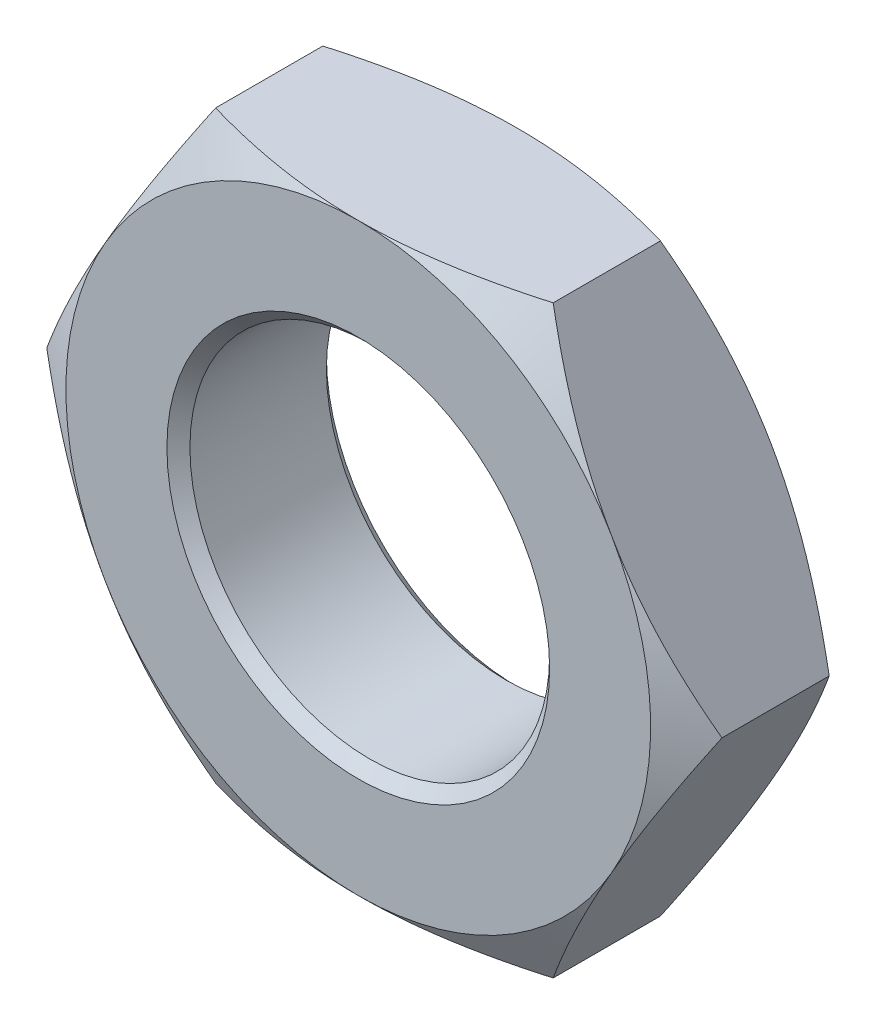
ISO-10303-21;
HEADER;
FILE_DESCRIPTION(('STEP AP214'),'2;1');
FILE_NAME('part.step','',(''),(''),'','','');
FILE_SCHEMA(('AUTOMOTIVE_DESIGN { 1 0 10303 214 1 1 1 1 }'));
ENDSEC;
DATA;
#1=APPLICATION_CONTEXT('core data for automotive mechanical design processes');
#2=APPLICATION_PROTOCOL_DEFINITION('international standard','automotive_design',2000,#1);
#3=PRODUCT_CONTEXT('',#1,'mechanical');
#4=PRODUCT('Part','Part','',(#3));
#5=PRODUCT_RELATED_PRODUCT_CATEGORY('part','',(#4));
#6=PRODUCT_DEFINITION_FORMATION('','',#4);
#7=PRODUCT_DEFINITION_CONTEXT('part definition',#1,'design');
#8=PRODUCT_DEFINITION('design','',#6,#7);
#9=PRODUCT_DEFINITION_SHAPE('','',#8);
#10=(LENGTH_UNIT() NAMED_UNIT(*) SI_UNIT(.MILLI.,.METRE.));
#11=(NAMED_UNIT(*) PLANE_ANGLE_UNIT() SI_UNIT($,.RADIAN.));
#12=(NAMED_UNIT(*) SI_UNIT($,.STERADIAN.) SOLID_ANGLE_UNIT());
#13=UNCERTAINTY_MEASURE_WITH_UNIT(LENGTH_MEASURE(1.E-05),#10,'distance_accuracy_value','');
#14=(GEOMETRIC_REPRESENTATION_CONTEXT(3) GLOBAL_UNCERTAINTY_ASSIGNED_CONTEXT((#13)) GLOBAL_UNIT_ASSIGNED_CONTEXT((#10,
#11,#12)) REPRESENTATION_CONTEXT('',''));
#15=CARTESIAN_POINT('',(0.,0.,0.));
#16=DIRECTION('',(0.,0.,1.));
#17=DIRECTION('',(1.,0.,0.));
#18=AXIS2_PLACEMENT_3D('',#15,#16,#17);
#19=CARTESIAN_POINT('',(23.8156986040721,-13.75,132.));
#20=DIRECTION('',(0.866025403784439,-0.5,0.));
#21=DIRECTION('',(-0.5,-0.866025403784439,0.));
#22=AXIS2_PLACEMENT_3D('',#19,#20,#21);
#23=PLANE('',#22);
#24=CARTESIAN_POINT('',(15.8689004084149,-27.5142582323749,128.539044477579));
#25=CARTESIAN_POINT('',(20.1280892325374,-20.1371267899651,131.));
#26=CARTESIAN_POINT('',(23.8156986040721,-13.75,131.));
#27=CARTESIAN_POINT('',(27.5033079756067,-7.36287321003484,131.));
#28=CARTESIAN_POINT('',(31.7624967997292,0.0142582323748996,128.539044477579));
#29=(BOUNDED_CURVE() B_SPLINE_CURVE(2,(#24,#25,#26,#27,#28),.UNSPECIFIED.,.F.,
.F.) B_SPLINE_CURVE_WITH_KNOTS((3,2,3),(0.,16.1241200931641,32.2482401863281),
.UNSPECIFIED.) CURVE() GEOMETRIC_REPRESENTATION_ITEM() RATIONAL_B_SPLINE_CURVE((1.,
1.03802697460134,1.,1.03802697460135,1.)) REPRESENTATION_ITEM(''));
#30=CARTESIAN_POINT('',(15.8771324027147,-27.5,128.543799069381));
#31=VERTEX_POINT('',#30);
#32=CARTESIAN_POINT('',(23.8156986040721,-13.75,131.));
#33=VERTEX_POINT('',#32);
#34=EDGE_CURVE('E145',#31,#33,#29,.T.);
#35=ORIENTED_EDGE('',*,*,#34,.F.);
#36=DIRECTION('',(0.,0.,-1.));
#37=VECTOR('',#36,1.);
#38=CARTESIAN_POINT('',(15.8771324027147,-27.5,132.));
#39=LINE('',#38,#37);
#40=CARTESIAN_POINT('',(15.8771324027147,-27.5,118.456200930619));
#41=VERTEX_POINT('',#40);
#42=EDGE_CURVE('E11',#31,#41,#39,.T.);
#43=ORIENTED_EDGE('',*,*,#42,.T.);
#44=CARTESIAN_POINT('',(31.7624967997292,0.0142582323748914,118.460955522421));
#45=CARTESIAN_POINT('',(27.5033079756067,-7.36287321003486,116.));
#46=CARTESIAN_POINT('',(23.8156986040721,-13.75,116.));
#47=CARTESIAN_POINT('',(20.1280892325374,-20.1371267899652,116.));
#48=CARTESIAN_POINT('',(15.8689004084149,-27.5142582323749,118.460955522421));
#49=(BOUNDED_CURVE() B_SPLINE_CURVE(2,(#44,#45,#46,#47,#48),.UNSPECIFIED.,.F.,
.F.) B_SPLINE_CURVE_WITH_KNOTS((3,2,3),(0.,16.1241200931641,32.2482401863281),
.UNSPECIFIED.) CURVE() GEOMETRIC_REPRESENTATION_ITEM() RATIONAL_B_SPLINE_CURVE((1.,
1.03802697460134,1.,1.03802697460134,1.)) REPRESENTATION_ITEM(''));
#50=CARTESIAN_POINT('',(23.8156986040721,-13.75,116.));
#51=VERTEX_POINT('',#50);
#52=EDGE_CURVE('E277',#51,#41,#49,.T.);
#53=ORIENTED_EDGE('',*,*,#52,.F.);
#54=CARTESIAN_POINT('',(31.7624967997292,0.0142582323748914,118.460955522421));
#55=CARTESIAN_POINT('',(27.5033079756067,-7.36287321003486,116.));
#56=CARTESIAN_POINT('',(23.8156986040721,-13.75,116.));
#57=CARTESIAN_POINT('',(20.1280892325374,-20.1371267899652,116.));
#58=CARTESIAN_POINT('',(15.8689004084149,-27.5142582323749,118.460955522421));
#59=(BOUNDED_CURVE() B_SPLINE_CURVE(2,(#54,#55,#56,#57,#58),.UNSPECIFIED.,.F.,
.F.) B_SPLINE_CURVE_WITH_KNOTS((3,2,3),(0.,16.1241200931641,32.2482401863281),
.UNSPECIFIED.) CURVE() GEOMETRIC_REPRESENTATION_ITEM() RATIONAL_B_SPLINE_CURVE((1.,
1.03802697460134,1.,1.03802697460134,1.)) REPRESENTATION_ITEM(''));
#60=CARTESIAN_POINT('',(31.7542648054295,0.,118.456200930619));
#61=VERTEX_POINT('',#60);
#62=EDGE_CURVE('E234',#61,#51,#59,.T.);
#63=ORIENTED_EDGE('',*,*,#62,.F.);
#64=DIRECTION('',(0.,0.,-1.));
#65=VECTOR('',#64,1.);
#66=CARTESIAN_POINT('',(31.7542648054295,0.,132.));
#67=LINE('',#66,#65);
#68=CARTESIAN_POINT('',(31.7542648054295,0.,128.543799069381));
#69=VERTEX_POINT('',#68);
#70=EDGE_CURVE('E112',#69,#61,#67,.T.);
#71=ORIENTED_EDGE('',*,*,#70,.F.);
#72=CARTESIAN_POINT('',(15.8689004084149,-27.5142582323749,128.539044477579));
#73=CARTESIAN_POINT('',(20.1280892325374,-20.1371267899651,131.));
#74=CARTESIAN_POINT('',(23.8156986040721,-13.75,131.));
#75=CARTESIAN_POINT('',(27.5033079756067,-7.36287321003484,131.));
#76=CARTESIAN_POINT('',(31.7624967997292,0.0142582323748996,128.539044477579));
#77=(BOUNDED_CURVE() B_SPLINE_CURVE(2,(#72,#73,#74,#75,#76),.UNSPECIFIED.,.F.,
.F.) B_SPLINE_CURVE_WITH_KNOTS((3,2,3),(0.,16.1241200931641,32.2482401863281),
.UNSPECIFIED.) CURVE() GEOMETRIC_REPRESENTATION_ITEM() RATIONAL_B_SPLINE_CURVE((1.,
1.03802697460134,1.,1.03802697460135,1.)) REPRESENTATION_ITEM(''));
#78=EDGE_CURVE('E147',#33,#69,#77,.T.);
#79=ORIENTED_EDGE('',*,*,#78,.F.);
#80=EDGE_LOOP('',(#35,#43,#53,#63,#71,#79));
#81=FACE_BOUND('',#80,.T.);
#82=ADVANCED_FACE('F16',(#81),#23,.T.);
#83=CARTESIAN_POINT('',(0.,-27.5,132.));
#84=DIRECTION('',(0.,-1.,0.));
#85=DIRECTION('',(-1.,0.,0.));
#86=AXIS2_PLACEMENT_3D('',#83,#84,#85);
#87=PLANE('',#86);
#88=CARTESIAN_POINT('',(-15.8935963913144,-27.5,128.539044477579));
#89=CARTESIAN_POINT('',(-7.37521874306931,-27.5,131.));
#90=CARTESIAN_POINT('',(0.,-27.5,131.));
#91=CARTESIAN_POINT('',(7.37521874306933,-27.5,131.));
#92=CARTESIAN_POINT('',(15.8935963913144,-27.5,128.539044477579));
#93=(BOUNDED_CURVE() B_SPLINE_CURVE(2,(#88,#89,#90,#91,#92),.UNSPECIFIED.,.F.,
.F.) B_SPLINE_CURVE_WITH_KNOTS((3,2,3),(0.,16.1241200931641,32.2482401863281),
.UNSPECIFIED.) CURVE() GEOMETRIC_REPRESENTATION_ITEM() RATIONAL_B_SPLINE_CURVE((1.,
1.03802697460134,1.,1.03802697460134,1.)) REPRESENTATION_ITEM(''));
#94=CARTESIAN_POINT('',(-15.8771324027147,-27.5,128.543799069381));
#95=VERTEX_POINT('',#94);
#96=CARTESIAN_POINT('',(0.,-27.5,131.));
#97=VERTEX_POINT('',#96);
#98=EDGE_CURVE('E152',#95,#97,#93,.T.);
#99=ORIENTED_EDGE('',*,*,#98,.F.);
#100=DIRECTION('',(0.,0.,-1.));
#101=VECTOR('',#100,1.);
#102=CARTESIAN_POINT('',(-15.8771324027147,-27.5,132.));
#103=LINE('',#102,#101);
#104=CARTESIAN_POINT('',(-15.8771324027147,-27.5,118.456200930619));
#105=VERTEX_POINT('',#104);
#106=EDGE_CURVE('E26',#95,#105,#103,.T.);
#107=ORIENTED_EDGE('',*,*,#106,.T.);
#108=CARTESIAN_POINT('',(15.8935963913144,-27.5,118.460955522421));
#109=CARTESIAN_POINT('',(7.3752187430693,-27.5,116.));
#110=CARTESIAN_POINT('',(0.,-27.5,116.));
#111=CARTESIAN_POINT('',(-7.37521874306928,-27.5,116.));
#112=CARTESIAN_POINT('',(-15.8935963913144,-27.5,118.460955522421));
#113=(BOUNDED_CURVE() B_SPLINE_CURVE(2,(#108,#109,#110,#111,#112),.UNSPECIFIED.,.F.,
.F.) B_SPLINE_CURVE_WITH_KNOTS((3,2,3),(0.,16.1241200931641,32.2482401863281),
.UNSPECIFIED.) CURVE() GEOMETRIC_REPRESENTATION_ITEM() RATIONAL_B_SPLINE_CURVE((1.,
1.03802697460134,1.,1.03802697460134,1.)) REPRESENTATION_ITEM(''));
#114=CARTESIAN_POINT('',(0.,-27.5,116.));
#115=VERTEX_POINT('',#114);
#116=EDGE_CURVE('E241',#115,#105,#113,.T.);
#117=ORIENTED_EDGE('',*,*,#116,.F.);
#118=CARTESIAN_POINT('',(15.8935963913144,-27.5,118.460955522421));
#119=CARTESIAN_POINT('',(7.3752187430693,-27.5,116.));
#120=CARTESIAN_POINT('',(0.,-27.5,116.));
#121=CARTESIAN_POINT('',(-7.37521874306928,-27.5,116.));
#122=CARTESIAN_POINT('',(-15.8935963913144,-27.5,118.460955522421));
#123=(BOUNDED_CURVE() B_SPLINE_CURVE(2,(#118,#119,#120,#121,#122),.UNSPECIFIED.,.F.,
.F.) B_SPLINE_CURVE_WITH_KNOTS((3,2,3),(0.,16.1241200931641,32.2482401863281),
.UNSPECIFIED.) CURVE() GEOMETRIC_REPRESENTATION_ITEM() RATIONAL_B_SPLINE_CURVE((1.,
1.03802697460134,1.,1.03802697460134,1.)) REPRESENTATION_ITEM(''));
#124=EDGE_CURVE('E142',#41,#115,#123,.T.);
#125=ORIENTED_EDGE('',*,*,#124,.F.);
#126=ORIENTED_EDGE('',*,*,#42,.F.);
#127=CARTESIAN_POINT('',(-15.8935963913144,-27.5,128.539044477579));
#128=CARTESIAN_POINT('',(-7.37521874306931,-27.5,131.));
#129=CARTESIAN_POINT('',(0.,-27.5,131.));
#130=CARTESIAN_POINT('',(7.37521874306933,-27.5,131.));
#131=CARTESIAN_POINT('',(15.8935963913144,-27.5,128.539044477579));
#132=(BOUNDED_CURVE() B_SPLINE_CURVE(2,(#127,#128,#129,#130,#131),.UNSPECIFIED.,.F.,
.F.) B_SPLINE_CURVE_WITH_KNOTS((3,2,3),(0.,16.1241200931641,32.2482401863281),
.UNSPECIFIED.) CURVE() GEOMETRIC_REPRESENTATION_ITEM() RATIONAL_B_SPLINE_CURVE((1.,
1.03802697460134,1.,1.03802697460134,1.)) REPRESENTATION_ITEM(''));
#133=EDGE_CURVE('E139',#97,#31,#132,.T.);
#134=ORIENTED_EDGE('',*,*,#133,.F.);
#135=EDGE_LOOP('',(#99,#107,#117,#125,#126,#134));
#136=FACE_BOUND('',#135,.T.);
#137=ADVANCED_FACE('F138',(#136),#87,.T.);
#138=CARTESIAN_POINT('',(-23.8156986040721,-13.75,132.));
#139=DIRECTION('',(-0.866025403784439,-0.5,0.));
#140=DIRECTION('',(-0.5,0.866025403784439,0.));
#141=AXIS2_PLACEMENT_3D('',#138,#139,#140);
#142=PLANE('',#141);
#143=CARTESIAN_POINT('',(-31.7624967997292,0.0142582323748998,128.539044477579));
#144=CARTESIAN_POINT('',(-27.5033079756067,-7.36287321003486,131.));
#145=CARTESIAN_POINT('',(-23.8156986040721,-13.75,131.));
#146=CARTESIAN_POINT('',(-20.1280892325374,-20.1371267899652,131.));
#147=CARTESIAN_POINT('',(-15.8689004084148,-27.5142582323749,128.539044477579));
#148=(BOUNDED_CURVE() B_SPLINE_CURVE(2,(#143,#144,#145,#146,#147),.UNSPECIFIED.,.F.,
.F.) B_SPLINE_CURVE_WITH_KNOTS((3,2,3),(0.,16.1241200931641,32.2482401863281),
.UNSPECIFIED.) CURVE() GEOMETRIC_REPRESENTATION_ITEM() RATIONAL_B_SPLINE_CURVE((1.,
1.03802697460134,1.,1.03802697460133,1.)) REPRESENTATION_ITEM(''));
#149=CARTESIAN_POINT('',(-31.7542648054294,0.,128.543799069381));
#150=VERTEX_POINT('',#149);
#151=CARTESIAN_POINT('',(-23.8156986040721,-13.75,131.));
#152=VERTEX_POINT('',#151);
#153=EDGE_CURVE('E179',#150,#152,#148,.T.);
#154=ORIENTED_EDGE('',*,*,#153,.F.);
#155=DIRECTION('',(0.,0.,-1.));
#156=VECTOR('',#155,1.);
#157=CARTESIAN_POINT('',(-31.7542648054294,0.,132.));
#158=LINE('',#157,#156);
#159=CARTESIAN_POINT('',(-31.7542648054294,0.,118.456200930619));
#160=VERTEX_POINT('',#159);
#161=EDGE_CURVE('E59',#150,#160,#158,.T.);
#162=ORIENTED_EDGE('',*,*,#161,.T.);
#163=CARTESIAN_POINT('',(-15.8689004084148,-27.5142582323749,118.460955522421));
#164=CARTESIAN_POINT('',(-20.1280892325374,-20.1371267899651,116.));
#165=CARTESIAN_POINT('',(-23.8156986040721,-13.75,116.));
#166=CARTESIAN_POINT('',(-27.5033079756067,-7.36287321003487,116.));
#167=CARTESIAN_POINT('',(-31.7624967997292,0.0142582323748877,118.460955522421));
#168=(BOUNDED_CURVE() B_SPLINE_CURVE(2,(#163,#164,#165,#166,#167),.UNSPECIFIED.,.F.,
.F.) B_SPLINE_CURVE_WITH_KNOTS((3,2,3),(0.,16.1241200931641,32.2482401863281),
.UNSPECIFIED.) CURVE() GEOMETRIC_REPRESENTATION_ITEM() RATIONAL_B_SPLINE_CURVE((1.,
1.03802697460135,1.,1.03802697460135,1.)) REPRESENTATION_ITEM(''));
#169=CARTESIAN_POINT('',(-23.8156986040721,-13.75,116.));
#170=VERTEX_POINT('',#169);
#171=EDGE_CURVE('E158',#170,#160,#168,.T.);
#172=ORIENTED_EDGE('',*,*,#171,.F.);
#173=CARTESIAN_POINT('',(-15.8689004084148,-27.5142582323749,118.460955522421));
#174=CARTESIAN_POINT('',(-20.1280892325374,-20.1371267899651,116.));
#175=CARTESIAN_POINT('',(-23.8156986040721,-13.75,116.));
#176=CARTESIAN_POINT('',(-27.5033079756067,-7.36287321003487,116.));
#177=CARTESIAN_POINT('',(-31.7624967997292,0.0142582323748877,118.460955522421));
#178=(BOUNDED_CURVE() B_SPLINE_CURVE(2,(#173,#174,#175,#176,#177),.UNSPECIFIED.,.F.,
.F.) B_SPLINE_CURVE_WITH_KNOTS((3,2,3),(0.,16.1241200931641,32.2482401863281),
.UNSPECIFIED.) CURVE() GEOMETRIC_REPRESENTATION_ITEM() RATIONAL_B_SPLINE_CURVE((1.,
1.03802697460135,1.,1.03802697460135,1.)) REPRESENTATION_ITEM(''));
#179=EDGE_CURVE('E242',#105,#170,#178,.T.);
#180=ORIENTED_EDGE('',*,*,#179,.F.);
#181=ORIENTED_EDGE('',*,*,#106,.F.);
#182=CARTESIAN_POINT('',(-31.7624967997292,0.0142582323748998,128.539044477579));
#183=CARTESIAN_POINT('',(-27.5033079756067,-7.36287321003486,131.));
#184=CARTESIAN_POINT('',(-23.8156986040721,-13.75,131.));
#185=CARTESIAN_POINT('',(-20.1280892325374,-20.1371267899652,131.));
#186=CARTESIAN_POINT('',(-15.8689004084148,-27.5142582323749,128.539044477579));
#187=(BOUNDED_CURVE() B_SPLINE_CURVE(2,(#182,#183,#184,#185,#186),.UNSPECIFIED.,.F.,
.F.) B_SPLINE_CURVE_WITH_KNOTS((3,2,3),(0.,16.1241200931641,32.2482401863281),
.UNSPECIFIED.) CURVE() GEOMETRIC_REPRESENTATION_ITEM() RATIONAL_B_SPLINE_CURVE((1.,
1.03802697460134,1.,1.03802697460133,1.)) REPRESENTATION_ITEM(''));
#188=EDGE_CURVE('E177',#152,#95,#187,.T.);
#189=ORIENTED_EDGE('',*,*,#188,.F.);
#190=EDGE_LOOP('',(#154,#162,#172,#180,#181,#189));
#191=FACE_BOUND('',#190,.T.);
#192=ADVANCED_FACE('F390',(#191),#142,.T.);
#193=CARTESIAN_POINT('',(23.8156986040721,13.75,132.));
#194=DIRECTION('',(0.866025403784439,0.5,0.));
#195=DIRECTION('',(0.5,-0.866025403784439,0.));
#196=AXIS2_PLACEMENT_3D('',#193,#194,#195);
#197=PLANE('',#196);
#198=CARTESIAN_POINT('',(31.7624967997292,-0.0142582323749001,128.539044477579));
#199=CARTESIAN_POINT('',(27.5033079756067,7.36287321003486,131.));
#200=CARTESIAN_POINT('',(23.8156986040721,13.75,131.));
#201=CARTESIAN_POINT('',(20.1280892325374,20.1371267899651,131.));
#202=CARTESIAN_POINT('',(15.8689004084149,27.5142582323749,128.539044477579));
#203=(BOUNDED_CURVE() B_SPLINE_CURVE(2,(#198,#199,#200,#201,#202),.UNSPECIFIED.,.F.,
.F.) B_SPLINE_CURVE_WITH_KNOTS((3,2,3),(0.,16.1241200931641,32.2482401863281),
.UNSPECIFIED.) CURVE() GEOMETRIC_REPRESENTATION_ITEM() RATIONAL_B_SPLINE_CURVE((1.,
1.03802697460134,1.,1.03802697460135,1.)) REPRESENTATION_ITEM(''));
#204=CARTESIAN_POINT('',(23.8156986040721,13.75,131.));
#205=VERTEX_POINT('',#204);
#206=CARTESIAN_POINT('',(15.8771324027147,27.5,128.543799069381));
#207=VERTEX_POINT('',#206);
#208=EDGE_CURVE('E256',#205,#207,#203,.T.);
#209=ORIENTED_EDGE('',*,*,#208,.F.);
#210=CARTESIAN_POINT('',(31.7624967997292,-0.0142582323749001,128.539044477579));
#211=CARTESIAN_POINT('',(27.5033079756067,7.36287321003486,131.));
#212=CARTESIAN_POINT('',(23.8156986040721,13.75,131.));
#213=CARTESIAN_POINT('',(20.1280892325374,20.1371267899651,131.));
#214=CARTESIAN_POINT('',(15.8689004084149,27.5142582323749,128.539044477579));
#215=(BOUNDED_CURVE() B_SPLINE_CURVE(2,(#210,#211,#212,#213,#214),.UNSPECIFIED.,.F.,
.F.) B_SPLINE_CURVE_WITH_KNOTS((3,2,3),(0.,16.1241200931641,32.2482401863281),
.UNSPECIFIED.) CURVE() GEOMETRIC_REPRESENTATION_ITEM() RATIONAL_B_SPLINE_CURVE((1.,
1.03802697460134,1.,1.03802697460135,1.)) REPRESENTATION_ITEM(''));
#216=EDGE_CURVE('E247',#69,#205,#215,.T.);
#217=ORIENTED_EDGE('',*,*,#216,.F.);
#218=ORIENTED_EDGE('',*,*,#70,.T.);
#219=CARTESIAN_POINT('',(15.8689004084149,27.5142582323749,118.460955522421));
#220=CARTESIAN_POINT('',(20.1280892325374,20.1371267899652,116.));
#221=CARTESIAN_POINT('',(23.8156986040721,13.75,116.));
#222=CARTESIAN_POINT('',(27.5033079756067,7.36287321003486,116.));
#223=CARTESIAN_POINT('',(31.7624967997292,-0.0142582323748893,118.460955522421));
#224=(BOUNDED_CURVE() B_SPLINE_CURVE(2,(#219,#220,#221,#222,#223),.UNSPECIFIED.,.F.,
.F.) B_SPLINE_CURVE_WITH_KNOTS((3,2,3),(0.,16.1241200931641,32.2482401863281),
.UNSPECIFIED.) CURVE() GEOMETRIC_REPRESENTATION_ITEM() RATIONAL_B_SPLINE_CURVE((1.,
1.03802697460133,1.,1.03802697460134,1.)) REPRESENTATION_ITEM(''));
#225=CARTESIAN_POINT('',(23.8156986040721,13.75,116.));
#226=VERTEX_POINT('',#225);
#227=EDGE_CURVE('E226',#226,#61,#224,.T.);
#228=ORIENTED_EDGE('',*,*,#227,.F.);
#229=CARTESIAN_POINT('',(15.8689004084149,27.5142582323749,118.460955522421));
#230=CARTESIAN_POINT('',(20.1280892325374,20.1371267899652,116.));
#231=CARTESIAN_POINT('',(23.8156986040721,13.75,116.));
#232=CARTESIAN_POINT('',(27.5033079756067,7.36287321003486,116.));
#233=CARTESIAN_POINT('',(31.7624967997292,-0.0142582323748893,118.460955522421));
#234=(BOUNDED_CURVE() B_SPLINE_CURVE(2,(#229,#230,#231,#232,#233),.UNSPECIFIED.,.F.,
.F.) B_SPLINE_CURVE_WITH_KNOTS((3,2,3),(0.,16.1241200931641,32.2482401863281),
.UNSPECIFIED.) CURVE() GEOMETRIC_REPRESENTATION_ITEM() RATIONAL_B_SPLINE_CURVE((1.,
1.03802697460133,1.,1.03802697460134,1.)) REPRESENTATION_ITEM(''));
#235=CARTESIAN_POINT('',(15.8771324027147,27.5,118.456200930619));
#236=VERTEX_POINT('',#235);
#237=EDGE_CURVE('E209',#236,#226,#234,.T.);
#238=ORIENTED_EDGE('',*,*,#237,.F.);
#239=DIRECTION('',(0.,0.,-1.));
#240=VECTOR('',#239,1.);
#241=CARTESIAN_POINT('',(15.8771324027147,27.5,132.));
#242=LINE('',#241,#240);
#243=EDGE_CURVE('E313',#207,#236,#242,.T.);
#244=ORIENTED_EDGE('',*,*,#243,.F.);
#245=EDGE_LOOP('',(#209,#217,#218,#228,#238,#244));
#246=FACE_BOUND('',#245,.T.);
#247=ADVANCED_FACE('F382',(#246),#197,.T.);
#248=CARTESIAN_POINT('',(0.,27.5,132.));
#249=DIRECTION('',(0.,1.,0.));
#250=DIRECTION('',(1.,0.,0.));
#251=AXIS2_PLACEMENT_3D('',#248,#249,#250);
#252=PLANE('',#251);
#253=CARTESIAN_POINT('',(15.8935963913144,27.5,128.539044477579));
#254=CARTESIAN_POINT('',(7.37521874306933,27.5,131.));
#255=CARTESIAN_POINT('',(0.,27.5,131.));
#256=CARTESIAN_POINT('',(-7.3752187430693,27.4999999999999,131.));
#257=CARTESIAN_POINT('',(-15.8935963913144,27.5,128.539044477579));
#258=(BOUNDED_CURVE() B_SPLINE_CURVE(2,(#253,#254,#255,#256,#257),.UNSPECIFIED.,.F.,
.F.) B_SPLINE_CURVE_WITH_KNOTS((3,2,3),(0.,16.1241200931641,32.2482401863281),
.UNSPECIFIED.) CURVE() GEOMETRIC_REPRESENTATION_ITEM() RATIONAL_B_SPLINE_CURVE((1.,
1.03802697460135,1.,1.03802697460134,1.)) REPRESENTATION_ITEM(''));
#259=CARTESIAN_POINT('',(0.,27.5,131.));
#260=VERTEX_POINT('',#259);
#261=CARTESIAN_POINT('',(-15.8771324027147,27.5,128.543799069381));
#262=VERTEX_POINT('',#261);
#263=EDGE_CURVE('E169',#260,#262,#258,.T.);
#264=ORIENTED_EDGE('',*,*,#263,.F.);
#265=CARTESIAN_POINT('',(15.8935963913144,27.5,128.539044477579));
#266=CARTESIAN_POINT('',(7.37521874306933,27.5,131.));
#267=CARTESIAN_POINT('',(0.,27.5,131.));
#268=CARTESIAN_POINT('',(-7.3752187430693,27.4999999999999,131.));
#269=CARTESIAN_POINT('',(-15.8935963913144,27.5,128.539044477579));
#270=(BOUNDED_CURVE() B_SPLINE_CURVE(2,(#265,#266,#267,#268,#269),.UNSPECIFIED.,.F.,
.F.) B_SPLINE_CURVE_WITH_KNOTS((3,2,3),(0.,16.1241200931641,32.2482401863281),
.UNSPECIFIED.) CURVE() GEOMETRIC_REPRESENTATION_ITEM() RATIONAL_B_SPLINE_CURVE((1.,
1.03802697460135,1.,1.03802697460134,1.)) REPRESENTATION_ITEM(''));
#271=EDGE_CURVE('E220',#207,#260,#270,.T.);
#272=ORIENTED_EDGE('',*,*,#271,.F.);
#273=ORIENTED_EDGE('',*,*,#243,.T.);
#274=CARTESIAN_POINT('',(-15.8935963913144,27.5,118.460955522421));
#275=CARTESIAN_POINT('',(-7.3752187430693,27.4999999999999,116.));
#276=CARTESIAN_POINT('',(0.,27.5,116.));
#277=CARTESIAN_POINT('',(7.37521874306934,27.5,116.));
#278=CARTESIAN_POINT('',(15.8935963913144,27.5,118.460955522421));
#279=(BOUNDED_CURVE() B_SPLINE_CURVE(2,(#274,#275,#276,#277,#278),.UNSPECIFIED.,.F.,
.F.) B_SPLINE_CURVE_WITH_KNOTS((3,2,3),(0.,16.1241200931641,32.2482401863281),
.UNSPECIFIED.) CURVE() GEOMETRIC_REPRESENTATION_ITEM() RATIONAL_B_SPLINE_CURVE((1.,
1.03802697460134,1.,1.03802697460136,1.)) REPRESENTATION_ITEM(''));
#280=CARTESIAN_POINT('',(0.,27.5,116.));
#281=VERTEX_POINT('',#280);
#282=EDGE_CURVE('E200',#281,#236,#279,.T.);
#283=ORIENTED_EDGE('',*,*,#282,.F.);
#284=CARTESIAN_POINT('',(-15.8935963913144,27.5,118.460955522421));
#285=CARTESIAN_POINT('',(-7.3752187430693,27.4999999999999,116.));
#286=CARTESIAN_POINT('',(0.,27.5,116.));
#287=CARTESIAN_POINT('',(7.37521874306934,27.5,116.));
#288=CARTESIAN_POINT('',(15.8935963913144,27.5,118.460955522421));
#289=(BOUNDED_CURVE() B_SPLINE_CURVE(2,(#284,#285,#286,#287,#288),.UNSPECIFIED.,.F.,
.F.) B_SPLINE_CURVE_WITH_KNOTS((3,2,3),(0.,16.1241200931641,32.2482401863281),
.UNSPECIFIED.) CURVE() GEOMETRIC_REPRESENTATION_ITEM() RATIONAL_B_SPLINE_CURVE((1.,
1.03802697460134,1.,1.03802697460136,1.)) REPRESENTATION_ITEM(''));
#290=CARTESIAN_POINT('',(-15.8771324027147,27.5,118.456200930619));
#291=VERTEX_POINT('',#290);
#292=EDGE_CURVE('E212',#291,#281,#289,.T.);
#293=ORIENTED_EDGE('',*,*,#292,.F.);
#294=DIRECTION('',(0.,0.,-1.));
#295=VECTOR('',#294,1.);
#296=CARTESIAN_POINT('',(-15.8771324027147,27.5,132.));
#297=LINE('',#296,#295);
#298=EDGE_CURVE('E122',#262,#291,#297,.T.);
#299=ORIENTED_EDGE('',*,*,#298,.F.);
#300=EDGE_LOOP('',(#264,#272,#273,#283,#293,#299));
#301=FACE_BOUND('',#300,.T.);
#302=ADVANCED_FACE('F18',(#301),#252,.T.);
#303=CARTESIAN_POINT('',(-23.8156986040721,13.75,132.));
#304=DIRECTION('',(-0.866025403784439,0.5,0.));
#305=DIRECTION('',(0.5,0.866025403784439,0.));
#306=AXIS2_PLACEMENT_3D('',#303,#304,#305);
#307=PLANE('',#306);
#308=CARTESIAN_POINT('',(-15.8689004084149,27.5142582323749,128.539044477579));
#309=CARTESIAN_POINT('',(-20.1280892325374,20.1371267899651,131.));
#310=CARTESIAN_POINT('',(-23.8156986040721,13.75,131.));
#311=CARTESIAN_POINT('',(-27.5033079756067,7.36287321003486,131.));
#312=CARTESIAN_POINT('',(-31.7624967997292,-0.0142582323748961,128.539044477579));
#313=(BOUNDED_CURVE() B_SPLINE_CURVE(2,(#308,#309,#310,#311,#312),.UNSPECIFIED.,.F.,
.F.) B_SPLINE_CURVE_WITH_KNOTS((3,2,3),(0.,16.1241200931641,32.2482401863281),
.UNSPECIFIED.) CURVE() GEOMETRIC_REPRESENTATION_ITEM() RATIONAL_B_SPLINE_CURVE((1.,
1.03802697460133,1.,1.03802697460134,1.)) REPRESENTATION_ITEM(''));
#314=CARTESIAN_POINT('',(-23.8156986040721,13.75,131.));
#315=VERTEX_POINT('',#314);
#316=EDGE_CURVE('E67',#315,#150,#313,.T.);
#317=ORIENTED_EDGE('',*,*,#316,.F.);
#318=CARTESIAN_POINT('',(-15.8689004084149,27.5142582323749,128.539044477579));
#319=CARTESIAN_POINT('',(-20.1280892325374,20.1371267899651,131.));
#320=CARTESIAN_POINT('',(-23.8156986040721,13.75,131.));
#321=CARTESIAN_POINT('',(-27.5033079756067,7.36287321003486,131.));
#322=CARTESIAN_POINT('',(-31.7624967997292,-0.0142582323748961,128.539044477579));
#323=(BOUNDED_CURVE() B_SPLINE_CURVE(2,(#318,#319,#320,#321,#322),.UNSPECIFIED.,.F.,
.F.) B_SPLINE_CURVE_WITH_KNOTS((3,2,3),(0.,16.1241200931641,32.2482401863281),
.UNSPECIFIED.) CURVE() GEOMETRIC_REPRESENTATION_ITEM() RATIONAL_B_SPLINE_CURVE((1.,
1.03802697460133,1.,1.03802697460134,1.)) REPRESENTATION_ITEM(''));
#324=EDGE_CURVE('E170',#262,#315,#323,.T.);
#325=ORIENTED_EDGE('',*,*,#324,.F.);
#326=ORIENTED_EDGE('',*,*,#298,.T.);
#327=CARTESIAN_POINT('',(-31.7624967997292,-0.014258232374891,118.460955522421));
#328=CARTESIAN_POINT('',(-27.5033079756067,7.36287321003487,116.));
#329=CARTESIAN_POINT('',(-23.8156986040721,13.75,116.));
#330=CARTESIAN_POINT('',(-20.1280892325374,20.1371267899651,116.));
#331=CARTESIAN_POINT('',(-15.8689004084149,27.5142582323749,118.460955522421));
#332=(BOUNDED_CURVE() B_SPLINE_CURVE(2,(#327,#328,#329,#330,#331),.UNSPECIFIED.,.F.,
.F.) B_SPLINE_CURVE_WITH_KNOTS((3,2,3),(0.,16.1241200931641,32.248240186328),
.UNSPECIFIED.) CURVE() GEOMETRIC_REPRESENTATION_ITEM() RATIONAL_B_SPLINE_CURVE((1.,
1.03802697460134,1.,1.03802697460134,1.)) REPRESENTATION_ITEM(''));
#333=CARTESIAN_POINT('',(-23.8156986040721,13.75,116.));
#334=VERTEX_POINT('',#333);
#335=EDGE_CURVE('E119',#334,#291,#332,.T.);
#336=ORIENTED_EDGE('',*,*,#335,.F.);
#337=CARTESIAN_POINT('',(-31.7624967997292,-0.014258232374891,118.460955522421));
#338=CARTESIAN_POINT('',(-27.5033079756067,7.36287321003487,116.));
#339=CARTESIAN_POINT('',(-23.8156986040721,13.75,116.));
#340=CARTESIAN_POINT('',(-20.1280892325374,20.1371267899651,116.));
#341=CARTESIAN_POINT('',(-15.8689004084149,27.5142582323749,118.460955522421));
#342=(BOUNDED_CURVE() B_SPLINE_CURVE(2,(#337,#338,#339,#340,#341),.UNSPECIFIED.,.F.,
.F.) B_SPLINE_CURVE_WITH_KNOTS((3,2,3),(0.,16.1241200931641,32.248240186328),
.UNSPECIFIED.) CURVE() GEOMETRIC_REPRESENTATION_ITEM() RATIONAL_B_SPLINE_CURVE((1.,
1.03802697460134,1.,1.03802697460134,1.)) REPRESENTATION_ITEM(''));
#343=EDGE_CURVE('E287',#160,#334,#342,.T.);
#344=ORIENTED_EDGE('',*,*,#343,.F.);
#345=ORIENTED_EDGE('',*,*,#161,.F.);
#346=EDGE_LOOP('',(#317,#325,#326,#336,#344,#345));
#347=FACE_BOUND('',#346,.T.);
#348=ADVANCED_FACE('F371',(#347),#307,.T.);
#349=CARTESIAN_POINT('',(22.75,0.,131.));
#350=DIRECTION('',(0.,0.,1.));
#351=DIRECTION('',(-1.,0.,0.));
#352=AXIS2_PLACEMENT_3D('',#349,#350,#351);
#353=PLANE('',#352);
#354=CARTESIAN_POINT('',(0.,0.,131.));
#355=DIRECTION('',(0.,0.,-1.));
#356=DIRECTION('',(1.,0.,0.));
#357=AXIS2_PLACEMENT_3D('',#354,#355,#356);
#358=CIRCLE('',#357,18.);
#359=CARTESIAN_POINT('',(18.,0.,131.));
#360=VERTEX_POINT('',#359);
#361=EDGE_CURVE('E33',#360,#360,#358,.T.);
#362=ORIENTED_EDGE('',*,*,#361,.T.);
#363=EDGE_LOOP('',(#362));
#364=FACE_BOUND('',#363,.T.);
#365=CARTESIAN_POINT('',(0.,0.,131.));
#366=DIRECTION('',(0.,0.,-1.));
#367=DIRECTION('',(1.,0.,0.));
#368=AXIS2_PLACEMENT_3D('',#365,#366,#367);
#369=CIRCLE('',#368,27.5);
#370=EDGE_CURVE('E271',#205,#33,#369,.T.);
#371=ORIENTED_EDGE('',*,*,#370,.F.);
#372=CARTESIAN_POINT('',(0.,0.,131.));
#373=DIRECTION('',(0.,0.,-1.));
#374=DIRECTION('',(1.,0.,0.));
#375=AXIS2_PLACEMENT_3D('',#372,#373,#374);
#376=CIRCLE('',#375,27.5);
#377=EDGE_CURVE('E225',#260,#205,#376,.T.);
#378=ORIENTED_EDGE('',*,*,#377,.F.);
#379=CARTESIAN_POINT('',(0.,0.,131.));
#380=DIRECTION('',(0.,0.,-1.));
#381=DIRECTION('',(1.,0.,0.));
#382=AXIS2_PLACEMENT_3D('',#379,#380,#381);
#383=CIRCLE('',#382,27.5);
#384=EDGE_CURVE('E166',#315,#260,#383,.T.);
#385=ORIENTED_EDGE('',*,*,#384,.F.);
#386=CARTESIAN_POINT('',(0.,0.,131.));
#387=DIRECTION('',(0.,0.,-1.));
#388=DIRECTION('',(1.,0.,0.));
#389=AXIS2_PLACEMENT_3D('',#386,#387,#388);
#390=CIRCLE('',#389,27.5);
#391=EDGE_CURVE('E178',#152,#315,#390,.T.);
#392=ORIENTED_EDGE('',*,*,#391,.F.);
#393=CARTESIAN_POINT('',(0.,0.,131.));
#394=DIRECTION('',(0.,0.,-1.));
#395=DIRECTION('',(1.,0.,0.));
#396=AXIS2_PLACEMENT_3D('',#393,#394,#395);
#397=CIRCLE('',#396,27.5);
#398=EDGE_CURVE('E150',#97,#152,#397,.T.);
#399=ORIENTED_EDGE('',*,*,#398,.F.);
#400=CARTESIAN_POINT('',(0.,0.,131.));
#401=DIRECTION('',(0.,0.,-1.));
#402=DIRECTION('',(1.,0.,0.));
#403=AXIS2_PLACEMENT_3D('',#400,#401,#402);
#404=CIRCLE('',#403,27.5);
#405=EDGE_CURVE('E133',#33,#97,#404,.T.);
#406=ORIENTED_EDGE('',*,*,#405,.F.);
#407=EDGE_LOOP('',(#371,#378,#385,#392,#399,#406));
#408=FACE_BOUND('',#407,.T.);
#409=ADVANCED_FACE('F373',(#364,#408),#353,.T.);
#410=CARTESIAN_POINT('',(0.,0.,130.45875));
#411=DIRECTION('',(0.,0.,1.));
#412=DIRECTION('',(1.,0.,0.));
#413=AXIS2_PLACEMENT_3D('',#410,#411,#412);
#414=CONICAL_SURFACE('',#413,17.45875,0.785398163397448);
#415=CARTESIAN_POINT('',(0.,0.,129.9175));
#416=DIRECTION('',(0.,0.,-1.));
#417=DIRECTION('',(1.,0.,0.));
#418=AXIS2_PLACEMENT_3D('',#415,#416,#417);
#419=CIRCLE('',#418,16.9175);
#420=CARTESIAN_POINT('',(16.9175,0.,129.9175));
#421=VERTEX_POINT('',#420);
#422=EDGE_CURVE('E173',#421,#421,#419,.T.);
#423=ORIENTED_EDGE('',*,*,#422,.T.);
#424=EDGE_LOOP('',(#423));
#425=FACE_BOUND('',#424,.T.);
#426=ORIENTED_EDGE('',*,*,#361,.F.);
#427=EDGE_LOOP('',(#426));
#428=FACE_BOUND('',#427,.T.);
#429=ADVANCED_FACE('F380',(#425,#428),#414,.F.);
#430=CARTESIAN_POINT('',(0.,0.,123.5));
#431=DIRECTION('',(0.,0.,1.));
#432=DIRECTION('',(1.,0.,0.));
#433=AXIS2_PLACEMENT_3D('',#430,#431,#432);
#434=CYLINDRICAL_SURFACE('',#433,16.9175);
#435=CARTESIAN_POINT('',(0.,0.,117.0825));
#436=DIRECTION('',(0.,0.,-1.));
#437=DIRECTION('',(1.,0.,0.));
#438=AXIS2_PLACEMENT_3D('',#435,#436,#437);
#439=CIRCLE('',#438,16.9175);
#440=CARTESIAN_POINT('',(16.9175,0.,117.0825));
#441=VERTEX_POINT('',#440);
#442=EDGE_CURVE('E171',#441,#441,#439,.T.);
#443=ORIENTED_EDGE('',*,*,#442,.T.);
#444=EDGE_LOOP('',(#443));
#445=FACE_BOUND('',#444,.T.);
#446=ORIENTED_EDGE('',*,*,#422,.F.);
#447=EDGE_LOOP('',(#446));
#448=FACE_BOUND('',#447,.T.);
#449=ADVANCED_FACE('F456',(#445,#448),#434,.F.);
#450=CARTESIAN_POINT('',(0.,0.,116.54125));
#451=DIRECTION('',(0.,0.,-1.));
#452=DIRECTION('',(1.,0.,0.));
#453=AXIS2_PLACEMENT_3D('',#450,#451,#452);
#454=CONICAL_SURFACE('',#453,17.45875,0.785398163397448);
#455=CARTESIAN_POINT('',(0.,0.,116.));
#456=DIRECTION('',(0.,0.,-1.));
#457=DIRECTION('',(1.,0.,0.));
#458=AXIS2_PLACEMENT_3D('',#455,#456,#457);
#459=CIRCLE('',#458,18.);
#460=CARTESIAN_POINT('',(18.,0.,116.));
#461=VERTEX_POINT('',#460);
#462=EDGE_CURVE('E20',#461,#461,#459,.T.);
#463=ORIENTED_EDGE('',*,*,#462,.T.);
#464=EDGE_LOOP('',(#463));
#465=FACE_BOUND('',#464,.T.);
#466=ORIENTED_EDGE('',*,*,#442,.F.);
#467=EDGE_LOOP('',(#466));
#468=FACE_BOUND('',#467,.T.);
#469=ADVANCED_FACE('F402',(#465,#468),#454,.F.);
#470=CARTESIAN_POINT('',(22.75,0.,116.));
#471=DIRECTION('',(0.,0.,-1.));
#472=DIRECTION('',(1.,0.,0.));
#473=AXIS2_PLACEMENT_3D('',#470,#471,#472);
#474=PLANE('',#473);
#475=CARTESIAN_POINT('',(0.,0.,116.));
#476=DIRECTION('',(0.,0.,-1.));
#477=DIRECTION('',(1.,0.,0.));
#478=AXIS2_PLACEMENT_3D('',#475,#476,#477);
#479=CIRCLE('',#478,27.5);
#480=EDGE_CURVE('E255',#226,#51,#479,.T.);
#481=ORIENTED_EDGE('',*,*,#480,.T.);
#482=CARTESIAN_POINT('',(0.,0.,116.));
#483=DIRECTION('',(0.,0.,-1.));
#484=DIRECTION('',(1.,0.,0.));
#485=AXIS2_PLACEMENT_3D('',#482,#483,#484);
#486=CIRCLE('',#485,27.5);
#487=EDGE_CURVE('E315',#51,#115,#486,.T.);
#488=ORIENTED_EDGE('',*,*,#487,.T.);
#489=CARTESIAN_POINT('',(0.,0.,116.));
#490=DIRECTION('',(0.,0.,-1.));
#491=DIRECTION('',(1.,0.,0.));
#492=AXIS2_PLACEMENT_3D('',#489,#490,#491);
#493=CIRCLE('',#492,27.5);
#494=EDGE_CURVE('E236',#115,#170,#493,.T.);
#495=ORIENTED_EDGE('',*,*,#494,.T.);
#496=CARTESIAN_POINT('',(0.,0.,116.));
#497=DIRECTION('',(0.,0.,-1.));
#498=DIRECTION('',(1.,0.,0.));
#499=AXIS2_PLACEMENT_3D('',#496,#497,#498);
#500=CIRCLE('',#499,27.5);
#501=EDGE_CURVE('E291',#170,#334,#500,.T.);
#502=ORIENTED_EDGE('',*,*,#501,.T.);
#503=CARTESIAN_POINT('',(0.,0.,116.));
#504=DIRECTION('',(0.,0.,-1.));
#505=DIRECTION('',(1.,0.,0.));
#506=AXIS2_PLACEMENT_3D('',#503,#504,#505);
#507=CIRCLE('',#506,27.5);
#508=EDGE_CURVE('E201',#334,#281,#507,.T.);
#509=ORIENTED_EDGE('',*,*,#508,.T.);
#510=CARTESIAN_POINT('',(0.,0.,116.));
#511=DIRECTION('',(0.,0.,-1.));
#512=DIRECTION('',(1.,0.,0.));
#513=AXIS2_PLACEMENT_3D('',#510,#511,#512);
#514=CIRCLE('',#513,27.5);
#515=EDGE_CURVE('E235',#281,#226,#514,.T.);
#516=ORIENTED_EDGE('',*,*,#515,.T.);
#517=EDGE_LOOP('',(#481,#488,#495,#502,#509,#516));
#518=FACE_BOUND('',#517,.T.);
#519=ORIENTED_EDGE('',*,*,#462,.F.);
#520=EDGE_LOOP('',(#519));
#521=FACE_BOUND('',#520,.T.);
#522=ADVANCED_FACE('F398',(#518,#521),#474,.T.);
#523=CARTESIAN_POINT('',(0.,0.,117.23047776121));
#524=DIRECTION('',(0.,0.,1.));
#525=DIRECTION('',(1.,0.,0.));
#526=AXIS2_PLACEMENT_3D('',#523,#524,#525);
#527=CONICAL_SURFACE('',#526,29.63125,1.0471975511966);
#528=ORIENTED_EDGE('',*,*,#52,.T.);
#529=ORIENTED_EDGE('',*,*,#124,.T.);
#530=ORIENTED_EDGE('',*,*,#487,.F.);
#531=EDGE_LOOP('',(#528,#529,#530));
#532=FACE_BOUND('',#531,.T.);
#533=ADVANCED_FACE('F401',(#532),#527,.T.);
#534=CARTESIAN_POINT('',(0.,0.,117.23047776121));
#535=DIRECTION('',(0.,0.,1.));
#536=DIRECTION('',(1.,0.,0.));
#537=AXIS2_PLACEMENT_3D('',#534,#535,#536);
#538=CONICAL_SURFACE('',#537,29.63125,1.0471975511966);
#539=ORIENTED_EDGE('',*,*,#227,.T.);
#540=ORIENTED_EDGE('',*,*,#62,.T.);
#541=ORIENTED_EDGE('',*,*,#480,.F.);
#542=EDGE_LOOP('',(#539,#540,#541));
#543=FACE_BOUND('',#542,.T.);
#544=ADVANCED_FACE('F414',(#543),#538,.T.);
#545=CARTESIAN_POINT('',(0.,0.,117.23047776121));
#546=DIRECTION('',(0.,0.,1.));
#547=DIRECTION('',(1.,0.,0.));
#548=AXIS2_PLACEMENT_3D('',#545,#546,#547);
#549=CONICAL_SURFACE('',#548,29.63125,1.0471975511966);
#550=ORIENTED_EDGE('',*,*,#282,.T.);
#551=ORIENTED_EDGE('',*,*,#237,.T.);
#552=ORIENTED_EDGE('',*,*,#515,.F.);
#553=EDGE_LOOP('',(#550,#551,#552));
#554=FACE_BOUND('',#553,.T.);
#555=ADVANCED_FACE('F397',(#554),#549,.T.);
#556=CARTESIAN_POINT('',(0.,0.,117.23047776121));
#557=DIRECTION('',(0.,0.,1.));
#558=DIRECTION('',(1.,0.,0.));
#559=AXIS2_PLACEMENT_3D('',#556,#557,#558);
#560=CONICAL_SURFACE('',#559,29.63125,1.0471975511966);
#561=ORIENTED_EDGE('',*,*,#292,.T.);
#562=ORIENTED_EDGE('',*,*,#508,.F.);
#563=ORIENTED_EDGE('',*,*,#335,.T.);
#564=EDGE_LOOP('',(#561,#562,#563));
#565=FACE_BOUND('',#564,.T.);
#566=ADVANCED_FACE('F393',(#565),#560,.T.);
#567=CARTESIAN_POINT('',(0.,0.,117.23047776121));
#568=DIRECTION('',(0.,0.,1.));
#569=DIRECTION('',(1.,0.,0.));
#570=AXIS2_PLACEMENT_3D('',#567,#568,#569);
#571=CONICAL_SURFACE('',#570,29.63125,1.0471975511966);
#572=ORIENTED_EDGE('',*,*,#343,.T.);
#573=ORIENTED_EDGE('',*,*,#501,.F.);
#574=ORIENTED_EDGE('',*,*,#171,.T.);
#575=EDGE_LOOP('',(#572,#573,#574));
#576=FACE_BOUND('',#575,.T.);
#577=ADVANCED_FACE('F396',(#576),#571,.T.);
#578=CARTESIAN_POINT('',(0.,0.,117.23047776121));
#579=DIRECTION('',(0.,0.,1.));
#580=DIRECTION('',(1.,0.,0.));
#581=AXIS2_PLACEMENT_3D('',#578,#579,#580);
#582=CONICAL_SURFACE('',#581,29.63125,1.0471975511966);
#583=ORIENTED_EDGE('',*,*,#179,.T.);
#584=ORIENTED_EDGE('',*,*,#494,.F.);
#585=ORIENTED_EDGE('',*,*,#116,.T.);
#586=EDGE_LOOP('',(#583,#584,#585));
#587=FACE_BOUND('',#586,.T.);
#588=ADVANCED_FACE('F403',(#587),#582,.T.);
#589=CARTESIAN_POINT('',(0.,0.,129.76952223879));
#590=DIRECTION('',(0.,0.,-1.));
#591=DIRECTION('',(1.,0.,0.));
#592=AXIS2_PLACEMENT_3D('',#589,#590,#591);
#593=CONICAL_SURFACE('',#592,29.63125,1.0471975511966);
#594=ORIENTED_EDGE('',*,*,#78,.T.);
#595=ORIENTED_EDGE('',*,*,#216,.T.);
#596=ORIENTED_EDGE('',*,*,#370,.T.);
#597=EDGE_LOOP('',(#594,#595,#596));
#598=FACE_BOUND('',#597,.T.);
#599=ADVANCED_FACE('F406',(#598),#593,.T.);
#600=CARTESIAN_POINT('',(0.,0.,129.76952223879));
#601=DIRECTION('',(0.,0.,-1.));
#602=DIRECTION('',(1.,0.,0.));
#603=AXIS2_PLACEMENT_3D('',#600,#601,#602);
#604=CONICAL_SURFACE('',#603,29.63125,1.0471975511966);
#605=ORIENTED_EDGE('',*,*,#133,.T.);
#606=ORIENTED_EDGE('',*,*,#34,.T.);
#607=ORIENTED_EDGE('',*,*,#405,.T.);
#608=EDGE_LOOP('',(#605,#606,#607));
#609=FACE_BOUND('',#608,.T.);
#610=ADVANCED_FACE('F149',(#609),#604,.T.);
#611=CARTESIAN_POINT('',(0.,0.,129.76952223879));
#612=DIRECTION('',(0.,0.,-1.));
#613=DIRECTION('',(1.,0.,0.));
#614=AXIS2_PLACEMENT_3D('',#611,#612,#613);
#615=CONICAL_SURFACE('',#614,29.63125,1.0471975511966);
#616=ORIENTED_EDGE('',*,*,#188,.T.);
#617=ORIENTED_EDGE('',*,*,#98,.T.);
#618=ORIENTED_EDGE('',*,*,#398,.T.);
#619=EDGE_LOOP('',(#616,#617,#618));
#620=FACE_BOUND('',#619,.T.);
#621=ADVANCED_FACE('F410',(#620),#615,.T.);
#622=CARTESIAN_POINT('',(0.,0.,129.76952223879));
#623=DIRECTION('',(0.,0.,-1.));
#624=DIRECTION('',(1.,0.,0.));
#625=AXIS2_PLACEMENT_3D('',#622,#623,#624);
#626=CONICAL_SURFACE('',#625,29.63125,1.0471975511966);
#627=ORIENTED_EDGE('',*,*,#153,.T.);
#628=ORIENTED_EDGE('',*,*,#391,.T.);
#629=ORIENTED_EDGE('',*,*,#316,.T.);
#630=EDGE_LOOP('',(#627,#628,#629));
#631=FACE_BOUND('',#630,.T.);
#632=ADVANCED_FACE('F423',(#631),#626,.T.);
#633=CARTESIAN_POINT('',(0.,0.,129.76952223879));
#634=DIRECTION('',(0.,0.,-1.));
#635=DIRECTION('',(1.,0.,0.));
#636=AXIS2_PLACEMENT_3D('',#633,#634,#635);
#637=CONICAL_SURFACE('',#636,29.63125,1.0471975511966);
#638=ORIENTED_EDGE('',*,*,#324,.T.);
#639=ORIENTED_EDGE('',*,*,#384,.T.);
#640=ORIENTED_EDGE('',*,*,#263,.T.);
#641=EDGE_LOOP('',(#638,#639,#640));
#642=FACE_BOUND('',#641,.T.);
#643=ADVANCED_FACE('F368',(#642),#637,.T.);
#644=CARTESIAN_POINT('',(0.,0.,129.76952223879));
#645=DIRECTION('',(0.,0.,-1.));
#646=DIRECTION('',(1.,0.,0.));
#647=AXIS2_PLACEMENT_3D('',#644,#645,#646);
#648=CONICAL_SURFACE('',#647,29.63125,1.0471975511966);
#649=ORIENTED_EDGE('',*,*,#271,.T.);
#650=ORIENTED_EDGE('',*,*,#377,.T.);
#651=ORIENTED_EDGE('',*,*,#208,.T.);
#652=EDGE_LOOP('',(#649,#650,#651));
#653=FACE_BOUND('',#652,.T.);
#654=ADVANCED_FACE('F417',(#653),#648,.T.);
#655=CLOSED_SHELL('',(#82,#137,#192,#247,#302,#348,#409,#429,#449,#469,#522,#533,#544,#555,#566,
#577,#588,#599,#610,#621,#632,#643,#654));
#656=MANIFOLD_SOLID_BREP('B1',#655);
#657=ADVANCED_BREP_SHAPE_REPRESENTATION('',(#18,#656),#14);
#658=SHAPE_DEFINITION_REPRESENTATION(#9,#657);
ENDSEC;
END-ISO-10303-21;
